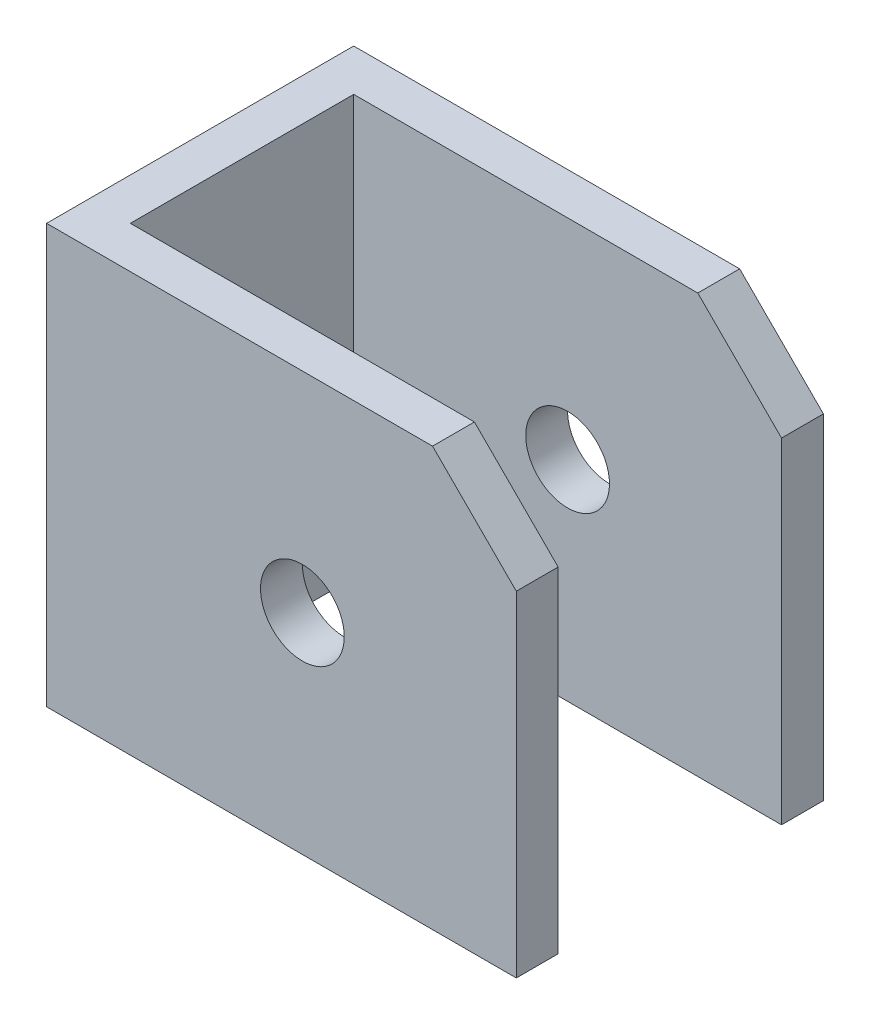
ISO-10303-21;
HEADER;
FILE_DESCRIPTION(('STEP AP214'),'2;1');
FILE_NAME('part.step','',(''),(''),'','','');
FILE_SCHEMA(('AUTOMOTIVE_DESIGN { 1 0 10303 214 1 1 1 1 }'));
ENDSEC;
DATA;
#1=APPLICATION_CONTEXT('core data for automotive mechanical design processes');
#2=APPLICATION_PROTOCOL_DEFINITION('international standard','automotive_design',2000,#1);
#3=PRODUCT_CONTEXT('',#1,'mechanical');
#4=PRODUCT('Part','Part','',(#3));
#5=PRODUCT_RELATED_PRODUCT_CATEGORY('part','',(#4));
#6=PRODUCT_DEFINITION_FORMATION('','',#4);
#7=PRODUCT_DEFINITION_CONTEXT('part definition',#1,'design');
#8=PRODUCT_DEFINITION('design','',#6,#7);
#9=PRODUCT_DEFINITION_SHAPE('','',#8);
#10=(LENGTH_UNIT() NAMED_UNIT(*) SI_UNIT(.MILLI.,.METRE.));
#11=(NAMED_UNIT(*) PLANE_ANGLE_UNIT() SI_UNIT($,.RADIAN.));
#12=(NAMED_UNIT(*) SI_UNIT($,.STERADIAN.) SOLID_ANGLE_UNIT());
#13=UNCERTAINTY_MEASURE_WITH_UNIT(LENGTH_MEASURE(1.E-05),#10,'distance_accuracy_value','');
#14=(GEOMETRIC_REPRESENTATION_CONTEXT(3) GLOBAL_UNCERTAINTY_ASSIGNED_CONTEXT((#13)) GLOBAL_UNIT_ASSIGNED_CONTEXT((#10,
#11,#12)) REPRESENTATION_CONTEXT('',''));
#15=CARTESIAN_POINT('',(0.,0.,0.));
#16=DIRECTION('',(0.,0.,1.));
#17=DIRECTION('',(1.,0.,0.));
#18=AXIS2_PLACEMENT_3D('',#15,#16,#17);
#19=CARTESIAN_POINT('',(-28.042707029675,50.,-13.3354564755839));
#20=DIRECTION('',(0.,0.,-1.));
#21=DIRECTION('',(-1.,0.,0.));
#22=AXIS2_PLACEMENT_3D('',#19,#20,#21);
#23=PLANE('',#22);
#24=CARTESIAN_POINT('',(2.50000000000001,25.,-13.3354564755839));
#25=DIRECTION('',(0.,0.,-1.));
#26=DIRECTION('',(-1.,0.,0.));
#27=AXIS2_PLACEMENT_3D('',#24,#25,#26);
#28=CIRCLE('',#27,4.99999999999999);
#29=CARTESIAN_POINT('',(-2.49999999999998,25.,-13.3354564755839));
#30=VERTEX_POINT('',#29);
#31=EDGE_CURVE('E151',#30,#30,#28,.T.);
#32=ORIENTED_EDGE('',*,*,#31,.T.);
#33=EDGE_LOOP('',(#32));
#34=FACE_BOUND('',#33,.T.);
#35=DIRECTION('',(0.,-1.,0.));
#36=VECTOR('',#35,1.);
#37=CARTESIAN_POINT('',(28.042707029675,50.,-13.3354564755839));
#38=LINE('',#37,#36);
#39=CARTESIAN_POINT('',(28.042707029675,40.,-13.3354564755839));
#40=VERTEX_POINT('',#39);
#41=CARTESIAN_POINT('',(28.042707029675,0.,-13.3354564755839));
#42=VERTEX_POINT('',#41);
#43=EDGE_CURVE('E178',#40,#42,#38,.T.);
#44=ORIENTED_EDGE('',*,*,#43,.F.);
#45=DIRECTION('',(-0.707106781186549,0.707106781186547,0.));
#46=VECTOR('',#45,1.);
#47=CARTESIAN_POINT('',(28.042707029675,40.,-13.3354564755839));
#48=LINE('',#47,#46);
#49=CARTESIAN_POINT('',(18.042707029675,50.,-13.3354564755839));
#50=VERTEX_POINT('',#49);
#51=EDGE_CURVE('E183',#40,#50,#48,.T.);
#52=ORIENTED_EDGE('',*,*,#51,.T.);
#53=DIRECTION('',(1.,0.,0.));
#54=VECTOR('',#53,1.);
#55=CARTESIAN_POINT('',(-28.042707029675,50.,-13.3354564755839));
#56=LINE('',#55,#54);
#57=CARTESIAN_POINT('',(-23.042707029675,50.,-13.3354564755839));
#58=VERTEX_POINT('',#57);
#59=EDGE_CURVE('E133',#58,#50,#56,.T.);
#60=ORIENTED_EDGE('',*,*,#59,.F.);
#61=DIRECTION('',(0.,-1.,0.));
#62=VECTOR('',#61,1.);
#63=CARTESIAN_POINT('',(-23.042707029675,50.,-13.3354564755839));
#64=LINE('',#63,#62);
#65=CARTESIAN_POINT('',(-23.042707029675,0.,-13.3354564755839));
#66=VERTEX_POINT('',#65);
#67=EDGE_CURVE('E146',#58,#66,#64,.T.);
#68=ORIENTED_EDGE('',*,*,#67,.T.);
#69=DIRECTION('',(1.,0.,0.));
#70=VECTOR('',#69,1.);
#71=CARTESIAN_POINT('',(-28.042707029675,0.,-13.3354564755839));
#72=LINE('',#71,#70);
#73=EDGE_CURVE('E147',#66,#42,#72,.T.);
#74=ORIENTED_EDGE('',*,*,#73,.T.);
#75=EDGE_LOOP('',(#44,#52,#60,#68,#74));
#76=FACE_BOUND('',#75,.T.);
#77=ADVANCED_FACE('F34',(#34,#76),#23,.F.);
#78=CARTESIAN_POINT('',(28.042707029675,50.,-18.3354564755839));
#79=DIRECTION('',(1.,0.,0.));
#80=DIRECTION('',(0.,0.,-1.));
#81=AXIS2_PLACEMENT_3D('',#78,#79,#80);
#82=PLANE('',#81);
#83=DIRECTION('',(0.,-1.,0.));
#84=VECTOR('',#83,1.);
#85=CARTESIAN_POINT('',(28.042707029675,50.,-18.3354564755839));
#86=LINE('',#85,#84);
#87=CARTESIAN_POINT('',(28.042707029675,40.,-18.3354564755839));
#88=VERTEX_POINT('',#87);
#89=CARTESIAN_POINT('',(28.042707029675,0.,-18.3354564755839));
#90=VERTEX_POINT('',#89);
#91=EDGE_CURVE('E122',#88,#90,#86,.T.);
#92=ORIENTED_EDGE('',*,*,#91,.F.);
#93=DIRECTION('',(0.,0.,1.));
#94=VECTOR('',#93,1.);
#95=CARTESIAN_POINT('',(28.042707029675,40.,-13.3354564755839));
#96=LINE('',#95,#94);
#97=EDGE_CURVE('E180',#88,#40,#96,.T.);
#98=ORIENTED_EDGE('',*,*,#97,.T.);
#99=ORIENTED_EDGE('',*,*,#43,.T.);
#100=DIRECTION('',(0.,0.,1.));
#101=VECTOR('',#100,1.);
#102=CARTESIAN_POINT('',(28.042707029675,0.,-18.3354564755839));
#103=LINE('',#102,#101);
#104=EDGE_CURVE('E150',#90,#42,#103,.T.);
#105=ORIENTED_EDGE('',*,*,#104,.F.);
#106=EDGE_LOOP('',(#92,#98,#99,#105));
#107=FACE_BOUND('',#106,.T.);
#108=ADVANCED_FACE('F237',(#107),#82,.T.);
#109=CARTESIAN_POINT('',(-28.042707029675,50.,-18.3354564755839));
#110=DIRECTION('',(0.,0.,-1.));
#111=DIRECTION('',(-1.,0.,0.));
#112=AXIS2_PLACEMENT_3D('',#109,#110,#111);
#113=PLANE('',#112);
#114=CARTESIAN_POINT('',(2.50000000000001,25.,-18.3354564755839));
#115=DIRECTION('',(0.,0.,1.));
#116=DIRECTION('',(1.,0.,0.));
#117=AXIS2_PLACEMENT_3D('',#114,#115,#116);
#118=CIRCLE('',#117,4.99999999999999);
#119=CARTESIAN_POINT('',(7.5,25.,-18.3354564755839));
#120=VERTEX_POINT('',#119);
#121=EDGE_CURVE('E218',#120,#120,#118,.T.);
#122=ORIENTED_EDGE('',*,*,#121,.T.);
#123=EDGE_LOOP('',(#122));
#124=FACE_BOUND('',#123,.T.);
#125=DIRECTION('',(1.,0.,0.));
#126=VECTOR('',#125,1.);
#127=CARTESIAN_POINT('',(-28.042707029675,50.,-18.3354564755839));
#128=LINE('',#127,#126);
#129=CARTESIAN_POINT('',(-28.042707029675,50.,-18.3354564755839));
#130=VERTEX_POINT('',#129);
#131=CARTESIAN_POINT('',(18.042707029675,50.,-18.3354564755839));
#132=VERTEX_POINT('',#131);
#133=EDGE_CURVE('E114',#130,#132,#128,.T.);
#134=ORIENTED_EDGE('',*,*,#133,.T.);
#135=DIRECTION('',(0.707106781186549,-0.707106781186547,0.));
#136=VECTOR('',#135,1.);
#137=CARTESIAN_POINT('',(-5.00000000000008,73.042707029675,-18.3354564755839));
#138=LINE('',#137,#136);
#139=EDGE_CURVE('E188',#132,#88,#138,.T.);
#140=ORIENTED_EDGE('',*,*,#139,.T.);
#141=ORIENTED_EDGE('',*,*,#91,.T.);
#142=DIRECTION('',(1.,0.,0.));
#143=VECTOR('',#142,1.);
#144=CARTESIAN_POINT('',(-28.042707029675,0.,-18.3354564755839));
#145=LINE('',#144,#143);
#146=CARTESIAN_POINT('',(-28.042707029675,0.,-18.3354564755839));
#147=VERTEX_POINT('',#146);
#148=EDGE_CURVE('E117',#147,#90,#145,.T.);
#149=ORIENTED_EDGE('',*,*,#148,.F.);
#150=DIRECTION('',(0.,-1.,0.));
#151=VECTOR('',#150,1.);
#152=CARTESIAN_POINT('',(-28.042707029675,50.,-18.3354564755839));
#153=LINE('',#152,#151);
#154=EDGE_CURVE('E111',#130,#147,#153,.T.);
#155=ORIENTED_EDGE('',*,*,#154,.F.);
#156=EDGE_LOOP('',(#134,#140,#141,#149,#155));
#157=FACE_BOUND('',#156,.T.);
#158=ADVANCED_FACE('F113',(#124,#157),#113,.T.);
#159=CARTESIAN_POINT('',(-28.042707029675,50.,-18.3354564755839));
#160=DIRECTION('',(-1.,0.,0.));
#161=DIRECTION('',(0.,0.,1.));
#162=AXIS2_PLACEMENT_3D('',#159,#160,#161);
#163=PLANE('',#162);
#164=DIRECTION('',(0.,0.,-1.));
#165=VECTOR('',#164,1.);
#166=CARTESIAN_POINT('',(-28.042707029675,0.,-18.3354564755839));
#167=LINE('',#166,#165);
#168=CARTESIAN_POINT('',(-28.042707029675,0.,18.3354564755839));
#169=VERTEX_POINT('',#168);
#170=EDGE_CURVE('E155',#169,#147,#167,.T.);
#171=ORIENTED_EDGE('',*,*,#170,.F.);
#172=DIRECTION('',(0.,-1.,0.));
#173=VECTOR('',#172,1.);
#174=CARTESIAN_POINT('',(-28.042707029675,50.,18.3354564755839));
#175=LINE('',#174,#173);
#176=CARTESIAN_POINT('',(-28.042707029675,50.,18.3354564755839));
#177=VERTEX_POINT('',#176);
#178=EDGE_CURVE('E123',#177,#169,#175,.T.);
#179=ORIENTED_EDGE('',*,*,#178,.F.);
#180=DIRECTION('',(0.,0.,-1.));
#181=VECTOR('',#180,1.);
#182=CARTESIAN_POINT('',(-28.042707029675,50.,-18.3354564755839));
#183=LINE('',#182,#181);
#184=EDGE_CURVE('E130',#177,#130,#183,.T.);
#185=ORIENTED_EDGE('',*,*,#184,.T.);
#186=ORIENTED_EDGE('',*,*,#154,.T.);
#187=EDGE_LOOP('',(#171,#179,#185,#186));
#188=FACE_BOUND('',#187,.T.);
#189=ADVANCED_FACE('F136',(#188),#163,.T.);
#190=CARTESIAN_POINT('',(-28.042707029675,50.,18.3354564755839));
#191=DIRECTION('',(0.,0.,1.));
#192=DIRECTION('',(1.,0.,0.));
#193=AXIS2_PLACEMENT_3D('',#190,#191,#192);
#194=PLANE('',#193);
#195=CARTESIAN_POINT('',(2.50000000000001,25.,18.3354564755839));
#196=DIRECTION('',(0.,0.,1.));
#197=DIRECTION('',(1.,0.,0.));
#198=AXIS2_PLACEMENT_3D('',#195,#196,#197);
#199=CIRCLE('',#198,4.99999999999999);
#200=CARTESIAN_POINT('',(7.5,25.,18.3354564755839));
#201=VERTEX_POINT('',#200);
#202=EDGE_CURVE('E221',#201,#201,#199,.T.);
#203=ORIENTED_EDGE('',*,*,#202,.F.);
#204=EDGE_LOOP('',(#203));
#205=FACE_BOUND('',#204,.T.);
#206=DIRECTION('',(0.,-1.,0.));
#207=VECTOR('',#206,1.);
#208=CARTESIAN_POINT('',(28.042707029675,50.,18.3354564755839));
#209=LINE('',#208,#207);
#210=CARTESIAN_POINT('',(28.042707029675,40.,18.3354564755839));
#211=VERTEX_POINT('',#210);
#212=CARTESIAN_POINT('',(28.042707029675,0.,18.3354564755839));
#213=VERTEX_POINT('',#212);
#214=EDGE_CURVE('E174',#211,#213,#209,.T.);
#215=ORIENTED_EDGE('',*,*,#214,.F.);
#216=DIRECTION('',(-0.707106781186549,0.707106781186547,0.));
#217=VECTOR('',#216,1.);
#218=CARTESIAN_POINT('',(-5.00000000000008,73.042707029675,18.3354564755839));
#219=LINE('',#218,#217);
#220=CARTESIAN_POINT('',(18.042707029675,50.,18.3354564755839));
#221=VERTEX_POINT('',#220);
#222=EDGE_CURVE('E43',#211,#221,#219,.T.);
#223=ORIENTED_EDGE('',*,*,#222,.T.);
#224=DIRECTION('',(-1.,0.,0.));
#225=VECTOR('',#224,1.);
#226=CARTESIAN_POINT('',(-28.042707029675,50.,18.3354564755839));
#227=LINE('',#226,#225);
#228=EDGE_CURVE('E137',#221,#177,#227,.T.);
#229=ORIENTED_EDGE('',*,*,#228,.T.);
#230=ORIENTED_EDGE('',*,*,#178,.T.);
#231=DIRECTION('',(-1.,0.,0.));
#232=VECTOR('',#231,1.);
#233=CARTESIAN_POINT('',(-28.042707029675,0.,18.3354564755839));
#234=LINE('',#233,#232);
#235=EDGE_CURVE('E157',#213,#169,#234,.T.);
#236=ORIENTED_EDGE('',*,*,#235,.F.);
#237=EDGE_LOOP('',(#215,#223,#229,#230,#236));
#238=FACE_BOUND('',#237,.T.);
#239=ADVANCED_FACE('F193',(#205,#238),#194,.T.);
#240=CARTESIAN_POINT('',(28.042707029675,50.,13.3354564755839));
#241=DIRECTION('',(1.,0.,0.));
#242=DIRECTION('',(0.,0.,-1.));
#243=AXIS2_PLACEMENT_3D('',#240,#241,#242);
#244=PLANE('',#243);
#245=DIRECTION('',(0.,-1.,0.));
#246=VECTOR('',#245,1.);
#247=CARTESIAN_POINT('',(28.042707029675,50.,13.3354564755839));
#248=LINE('',#247,#246);
#249=CARTESIAN_POINT('',(28.042707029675,40.,13.3354564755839));
#250=VERTEX_POINT('',#249);
#251=CARTESIAN_POINT('',(28.042707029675,0.,13.3354564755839));
#252=VERTEX_POINT('',#251);
#253=EDGE_CURVE('E172',#250,#252,#248,.T.);
#254=ORIENTED_EDGE('',*,*,#253,.F.);
#255=DIRECTION('',(0.,0.,1.));
#256=VECTOR('',#255,1.);
#257=CARTESIAN_POINT('',(28.042707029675,40.,18.3354564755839));
#258=LINE('',#257,#256);
#259=EDGE_CURVE('E190',#250,#211,#258,.T.);
#260=ORIENTED_EDGE('',*,*,#259,.T.);
#261=ORIENTED_EDGE('',*,*,#214,.T.);
#262=DIRECTION('',(0.,0.,1.));
#263=VECTOR('',#262,1.);
#264=CARTESIAN_POINT('',(28.042707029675,0.,13.3354564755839));
#265=LINE('',#264,#263);
#266=EDGE_CURVE('E160',#252,#213,#265,.T.);
#267=ORIENTED_EDGE('',*,*,#266,.F.);
#268=EDGE_LOOP('',(#254,#260,#261,#267));
#269=FACE_BOUND('',#268,.T.);
#270=ADVANCED_FACE('F196',(#269),#244,.T.);
#271=CARTESIAN_POINT('',(-28.042707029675,50.,13.3354564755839));
#272=DIRECTION('',(0.,0.,1.));
#273=DIRECTION('',(1.,0.,0.));
#274=AXIS2_PLACEMENT_3D('',#271,#272,#273);
#275=PLANE('',#274);
#276=CARTESIAN_POINT('',(2.50000000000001,25.,13.3354564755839));
#277=DIRECTION('',(0.,0.,1.));
#278=DIRECTION('',(1.,0.,0.));
#279=AXIS2_PLACEMENT_3D('',#276,#277,#278);
#280=CIRCLE('',#279,4.99999999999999);
#281=CARTESIAN_POINT('',(7.5,25.,13.3354564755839));
#282=VERTEX_POINT('',#281);
#283=EDGE_CURVE('E215',#282,#282,#280,.T.);
#284=ORIENTED_EDGE('',*,*,#283,.T.);
#285=EDGE_LOOP('',(#284));
#286=FACE_BOUND('',#285,.T.);
#287=DIRECTION('',(1.,0.,0.));
#288=VECTOR('',#287,1.);
#289=CARTESIAN_POINT('',(-28.042707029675,50.,13.3354564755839));
#290=LINE('',#289,#288);
#291=CARTESIAN_POINT('',(18.042707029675,50.,13.3354564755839));
#292=VERTEX_POINT('',#291);
#293=CARTESIAN_POINT('',(-23.042707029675,50.,13.3354564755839));
#294=VERTEX_POINT('',#293);
#295=EDGE_CURVE('E139',#292,#294,#290,.F.);
#296=ORIENTED_EDGE('',*,*,#295,.F.);
#297=DIRECTION('',(0.707106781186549,-0.707106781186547,0.));
#298=VECTOR('',#297,1.);
#299=CARTESIAN_POINT('',(28.042707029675,40.,13.3354564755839));
#300=LINE('',#299,#298);
#301=EDGE_CURVE('E11',#292,#250,#300,.T.);
#302=ORIENTED_EDGE('',*,*,#301,.T.);
#303=ORIENTED_EDGE('',*,*,#253,.T.);
#304=DIRECTION('',(1.,0.,0.));
#305=VECTOR('',#304,1.);
#306=CARTESIAN_POINT('',(-28.042707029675,0.,13.3354564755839));
#307=LINE('',#306,#305);
#308=CARTESIAN_POINT('',(-23.042707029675,0.,13.3354564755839));
#309=VERTEX_POINT('',#308);
#310=EDGE_CURVE('E163',#252,#309,#307,.F.);
#311=ORIENTED_EDGE('',*,*,#310,.T.);
#312=DIRECTION('',(0.,-1.,0.));
#313=VECTOR('',#312,1.);
#314=CARTESIAN_POINT('',(-23.042707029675,50.,13.3354564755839));
#315=LINE('',#314,#313);
#316=EDGE_CURVE('E169',#294,#309,#315,.T.);
#317=ORIENTED_EDGE('',*,*,#316,.F.);
#318=EDGE_LOOP('',(#296,#302,#303,#311,#317));
#319=FACE_BOUND('',#318,.T.);
#320=ADVANCED_FACE('F199',(#286,#319),#275,.F.);
#321=CARTESIAN_POINT('',(-23.042707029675,50.,-18.3354564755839));
#322=DIRECTION('',(-1.,0.,0.));
#323=DIRECTION('',(0.,0.,1.));
#324=AXIS2_PLACEMENT_3D('',#321,#322,#323);
#325=PLANE('',#324);
#326=DIRECTION('',(0.,0.,-1.));
#327=VECTOR('',#326,1.);
#328=CARTESIAN_POINT('',(-23.042707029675,0.,-18.3354564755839));
#329=LINE('',#328,#327);
#330=EDGE_CURVE('E165',#309,#66,#329,.T.);
#331=ORIENTED_EDGE('',*,*,#330,.T.);
#332=ORIENTED_EDGE('',*,*,#67,.F.);
#333=DIRECTION('',(0.,0.,-1.));
#334=VECTOR('',#333,1.);
#335=CARTESIAN_POINT('',(-23.042707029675,50.,-18.3354564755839));
#336=LINE('',#335,#334);
#337=EDGE_CURVE('E144',#294,#58,#336,.T.);
#338=ORIENTED_EDGE('',*,*,#337,.F.);
#339=ORIENTED_EDGE('',*,*,#316,.T.);
#340=EDGE_LOOP('',(#331,#332,#338,#339));
#341=FACE_BOUND('',#340,.T.);
#342=ADVANCED_FACE('F207',(#341),#325,.F.);
#343=CARTESIAN_POINT('',(0.,50.,0.));
#344=DIRECTION('',(0.,-1.,0.));
#345=DIRECTION('',(-1.,0.,0.));
#346=AXIS2_PLACEMENT_3D('',#343,#344,#345);
#347=PLANE('',#346);
#348=ORIENTED_EDGE('',*,*,#59,.T.);
#349=DIRECTION('',(0.,0.,-1.));
#350=VECTOR('',#349,1.);
#351=CARTESIAN_POINT('',(18.042707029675,50.,-18.3354564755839));
#352=LINE('',#351,#350);
#353=EDGE_CURVE('E132',#50,#132,#352,.T.);
#354=ORIENTED_EDGE('',*,*,#353,.T.);
#355=ORIENTED_EDGE('',*,*,#133,.F.);
#356=ORIENTED_EDGE('',*,*,#184,.F.);
#357=ORIENTED_EDGE('',*,*,#228,.F.);
#358=DIRECTION('',(0.,0.,-1.));
#359=VECTOR('',#358,1.);
#360=CARTESIAN_POINT('',(18.042707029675,50.,13.3354564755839));
#361=LINE('',#360,#359);
#362=EDGE_CURVE('E185',#221,#292,#361,.T.);
#363=ORIENTED_EDGE('',*,*,#362,.T.);
#364=ORIENTED_EDGE('',*,*,#295,.T.);
#365=ORIENTED_EDGE('',*,*,#337,.T.);
#366=EDGE_LOOP('',(#348,#354,#355,#356,#357,#363,#364,#365));
#367=FACE_BOUND('',#366,.T.);
#368=ADVANCED_FACE('F128',(#367),#347,.F.);
#369=CARTESIAN_POINT('',(0.,0.,0.));
#370=DIRECTION('',(0.,-1.,0.));
#371=DIRECTION('',(-1.,0.,0.));
#372=AXIS2_PLACEMENT_3D('',#369,#370,#371);
#373=PLANE('',#372);
#374=ORIENTED_EDGE('',*,*,#73,.F.);
#375=ORIENTED_EDGE('',*,*,#330,.F.);
#376=ORIENTED_EDGE('',*,*,#310,.F.);
#377=ORIENTED_EDGE('',*,*,#266,.T.);
#378=ORIENTED_EDGE('',*,*,#235,.T.);
#379=ORIENTED_EDGE('',*,*,#170,.T.);
#380=ORIENTED_EDGE('',*,*,#148,.T.);
#381=ORIENTED_EDGE('',*,*,#104,.T.);
#382=EDGE_LOOP('',(#374,#375,#376,#377,#378,#379,#380,#381));
#383=FACE_BOUND('',#382,.T.);
#384=ADVANCED_FACE('F204',(#383),#373,.T.);
#385=CARTESIAN_POINT('',(2.50000000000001,25.,18.3354564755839));
#386=DIRECTION('',(0.,0.,1.));
#387=DIRECTION('',(1.,0.,0.));
#388=AXIS2_PLACEMENT_3D('',#385,#386,#387);
#389=CYLINDRICAL_SURFACE('',#388,4.99999999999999);
#390=ORIENTED_EDGE('',*,*,#121,.F.);
#391=EDGE_LOOP('',(#390));
#392=FACE_BOUND('',#391,.T.);
#393=ORIENTED_EDGE('',*,*,#31,.F.);
#394=EDGE_LOOP('',(#393));
#395=FACE_BOUND('',#394,.T.);
#396=ADVANCED_FACE('F256',(#392,#395),#389,.F.);
#397=ORIENTED_EDGE('',*,*,#202,.T.);
#398=EDGE_LOOP('',(#397));
#399=FACE_BOUND('',#398,.T.);
#400=ORIENTED_EDGE('',*,*,#283,.F.);
#401=EDGE_LOOP('',(#400));
#402=FACE_BOUND('',#401,.T.);
#403=ADVANCED_FACE('F225',(#399,#402),#389,.F.);
#404=CARTESIAN_POINT('',(28.042707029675,40.,-18.3354564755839));
#405=DIRECTION('',(0.707106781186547,0.707106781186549,0.));
#406=DIRECTION('',(0.,0.,-1.));
#407=AXIS2_PLACEMENT_3D('',#404,#405,#406);
#408=PLANE('',#407);
#409=ORIENTED_EDGE('',*,*,#139,.F.);
#410=ORIENTED_EDGE('',*,*,#353,.F.);
#411=ORIENTED_EDGE('',*,*,#51,.F.);
#412=ORIENTED_EDGE('',*,*,#97,.F.);
#413=EDGE_LOOP('',(#409,#410,#411,#412));
#414=FACE_BOUND('',#413,.T.);
#415=ADVANCED_FACE('F247',(#414),#408,.T.);
#416=CARTESIAN_POINT('',(28.042707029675,40.,13.3354564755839));
#417=DIRECTION('',(0.707106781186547,0.707106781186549,0.));
#418=DIRECTION('',(0.,0.,-1.));
#419=AXIS2_PLACEMENT_3D('',#416,#417,#418);
#420=PLANE('',#419);
#421=ORIENTED_EDGE('',*,*,#301,.F.);
#422=ORIENTED_EDGE('',*,*,#362,.F.);
#423=ORIENTED_EDGE('',*,*,#222,.F.);
#424=ORIENTED_EDGE('',*,*,#259,.F.);
#425=EDGE_LOOP('',(#421,#422,#423,#424));
#426=FACE_BOUND('',#425,.T.);
#427=ADVANCED_FACE('F37',(#426),#420,.T.);
#428=CLOSED_SHELL('',(#77,#108,#158,#189,#239,#270,#320,#342,#368,#384,#396,#403,#415,#427));
#429=MANIFOLD_SOLID_BREP('B2',#428);
#430=ADVANCED_BREP_SHAPE_REPRESENTATION('',(#18,#429),#14);
#431=SHAPE_DEFINITION_REPRESENTATION(#9,#430);
ENDSEC;
END-ISO-10303-21;
